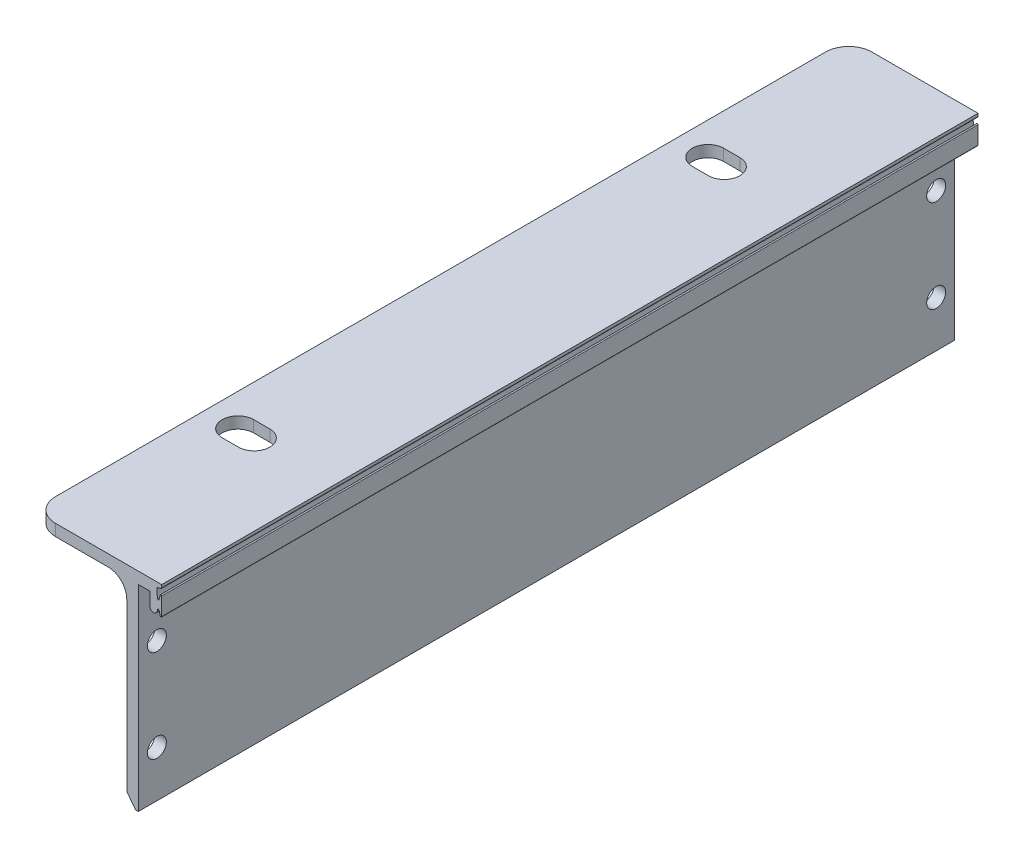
ISO-10303-21;
HEADER;
FILE_DESCRIPTION(('STEP AP214'),'2;1');
FILE_NAME('part.step','',(''),(''),'','','');
FILE_SCHEMA(('AUTOMOTIVE_DESIGN { 1 0 10303 214 1 1 1 1 }'));
ENDSEC;
DATA;
#1=APPLICATION_CONTEXT('core data for automotive mechanical design processes');
#2=APPLICATION_PROTOCOL_DEFINITION('international standard','automotive_design',2000,#1);
#3=PRODUCT_CONTEXT('',#1,'mechanical');
#4=PRODUCT('Part','Part','',(#3));
#5=PRODUCT_RELATED_PRODUCT_CATEGORY('part','',(#4));
#6=PRODUCT_DEFINITION_FORMATION('','',#4);
#7=PRODUCT_DEFINITION_CONTEXT('part definition',#1,'design');
#8=PRODUCT_DEFINITION('design','',#6,#7);
#9=PRODUCT_DEFINITION_SHAPE('','',#8);
#10=(LENGTH_UNIT() NAMED_UNIT(*) SI_UNIT(.MILLI.,.METRE.));
#11=(NAMED_UNIT(*) PLANE_ANGLE_UNIT() SI_UNIT($,.RADIAN.));
#12=(NAMED_UNIT(*) SI_UNIT($,.STERADIAN.) SOLID_ANGLE_UNIT());
#13=UNCERTAINTY_MEASURE_WITH_UNIT(LENGTH_MEASURE(1.E-05),#10,'distance_accuracy_value','');
#14=(GEOMETRIC_REPRESENTATION_CONTEXT(3) GLOBAL_UNCERTAINTY_ASSIGNED_CONTEXT((#13)) GLOBAL_UNIT_ASSIGNED_CONTEXT((#10,
#11,#12)) REPRESENTATION_CONTEXT('',''));
#15=CARTESIAN_POINT('',(0.,0.,0.));
#16=DIRECTION('',(0.,0.,1.));
#17=DIRECTION('',(1.,0.,0.));
#18=AXIS2_PLACEMENT_3D('',#15,#16,#17);
#19=CARTESIAN_POINT('',(2128.435090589,-3070.271459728,88.225));
#20=DIRECTION('',(0.,0.,-1.));
#21=DIRECTION('',(-1.,0.,0.));
#22=AXIS2_PLACEMENT_3D('',#19,#20,#21);
#23=CYLINDRICAL_SURFACE('',#22,4.);
#24=CARTESIAN_POINT('',(2128.435090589,-3070.271459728,-88.225));
#25=DIRECTION('',(0.,0.,1.));
#26=DIRECTION('',(1.,0.,0.));
#27=AXIS2_PLACEMENT_3D('',#24,#25,#26);
#28=CIRCLE('',#27,4.);
#29=CARTESIAN_POINT('',(2132.435090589,-3070.271459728,-88.225));
#30=VERTEX_POINT('',#29);
#31=CARTESIAN_POINT('',(2128.435090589,-3066.271459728,-88.225));
#32=VERTEX_POINT('',#31);
#33=EDGE_CURVE('E391',#30,#32,#28,.T.);
#34=ORIENTED_EDGE('',*,*,#33,.F.);
#35=DIRECTION('',(0.,0.,-1.));
#36=VECTOR('',#35,1.);
#37=CARTESIAN_POINT('',(2132.435090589,-3070.271459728,88.225));
#38=LINE('',#37,#36);
#39=CARTESIAN_POINT('',(2132.435090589,-3070.271459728,88.225));
#40=VERTEX_POINT('',#39);
#41=EDGE_CURVE('E506',#40,#30,#38,.T.);
#42=ORIENTED_EDGE('',*,*,#41,.F.);
#43=CARTESIAN_POINT('',(2128.435090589,-3070.271459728,88.225));
#44=DIRECTION('',(0.,0.,1.));
#45=DIRECTION('',(1.,0.,0.));
#46=AXIS2_PLACEMENT_3D('',#43,#44,#45);
#47=CIRCLE('',#46,4.);
#48=CARTESIAN_POINT('',(2128.435090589,-3066.271459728,88.225));
#49=VERTEX_POINT('',#48);
#50=EDGE_CURVE('E333',#40,#49,#47,.T.);
#51=ORIENTED_EDGE('',*,*,#50,.T.);
#52=DIRECTION('',(0.,0.,-1.));
#53=VECTOR('',#52,1.);
#54=CARTESIAN_POINT('',(2128.435090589,-3066.271459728,88.225));
#55=LINE('',#54,#53);
#56=EDGE_CURVE('E390',#49,#32,#55,.T.);
#57=ORIENTED_EDGE('',*,*,#56,.T.);
#58=EDGE_LOOP('',(#34,#42,#51,#57));
#59=FACE_BOUND('',#58,.T.);
#60=ADVANCED_FACE('F39',(#59),#23,.F.);
#61=CARTESIAN_POINT('',(2132.43509058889,7.89159512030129E-11,88.225));
#62=DIRECTION('',(1.,0.,0.));
#63=DIRECTION('',(0.,1.,0.));
#64=AXIS2_PLACEMENT_3D('',#61,#62,#63);
#65=PLANE('',#64);
#66=CARTESIAN_POINT('',(2132.435090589,-3078.771459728,84.225));
#67=DIRECTION('',(-1.,0.,0.));
#68=DIRECTION('',(0.,1.,0.));
#69=AXIS2_PLACEMENT_3D('',#66,#67,#68);
#70=CIRCLE('',#69,2.0499999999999);
#71=CARTESIAN_POINT('',(2132.435090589,-3076.721459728,84.225));
#72=VERTEX_POINT('',#71);
#73=EDGE_CURVE('E311',#72,#72,#70,.T.);
#74=ORIENTED_EDGE('',*,*,#73,.F.);
#75=EDGE_LOOP('',(#74));
#76=FACE_BOUND('',#75,.T.);
#77=CARTESIAN_POINT('',(2132.435090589,-3098.771459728,84.225));
#78=DIRECTION('',(-1.,0.,0.));
#79=DIRECTION('',(0.,1.,0.));
#80=AXIS2_PLACEMENT_3D('',#77,#78,#79);
#81=CIRCLE('',#80,2.0499999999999);
#82=CARTESIAN_POINT('',(2132.435090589,-3096.721459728,84.225));
#83=VERTEX_POINT('',#82);
#84=EDGE_CURVE('E321',#83,#83,#81,.T.);
#85=ORIENTED_EDGE('',*,*,#84,.F.);
#86=EDGE_LOOP('',(#85));
#87=FACE_BOUND('',#86,.T.);
#88=CARTESIAN_POINT('',(2132.435090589,-3098.771459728,-84.225));
#89=DIRECTION('',(-1.,0.,0.));
#90=DIRECTION('',(0.,-1.,0.));
#91=AXIS2_PLACEMENT_3D('',#88,#89,#90);
#92=CIRCLE('',#91,2.0499999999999);
#93=CARTESIAN_POINT('',(2132.435090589,-3100.821459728,-84.225));
#94=VERTEX_POINT('',#93);
#95=EDGE_CURVE('E325',#94,#94,#92,.T.);
#96=ORIENTED_EDGE('',*,*,#95,.F.);
#97=EDGE_LOOP('',(#96));
#98=FACE_BOUND('',#97,.T.);
#99=CARTESIAN_POINT('',(2132.435090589,-3078.771459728,-84.225));
#100=DIRECTION('',(-1.,0.,0.));
#101=DIRECTION('',(0.,-1.,0.));
#102=AXIS2_PLACEMENT_3D('',#99,#100,#101);
#103=CIRCLE('',#102,2.0499999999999);
#104=CARTESIAN_POINT('',(2132.435090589,-3080.821459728,-84.225));
#105=VERTEX_POINT('',#104);
#106=EDGE_CURVE('E329',#105,#105,#103,.T.);
#107=ORIENTED_EDGE('',*,*,#106,.F.);
#108=EDGE_LOOP('',(#107));
#109=FACE_BOUND('',#108,.T.);
#110=DIRECTION('',(0.,-1.,0.));
#111=VECTOR('',#110,1.);
#112=CARTESIAN_POINT('',(2132.43509058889,7.89159512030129E-11,-88.225));
#113=LINE('',#112,#111);
#114=CARTESIAN_POINT('',(2132.435090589,-3106.271459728,-88.225));
#115=VERTEX_POINT('',#114);
#116=EDGE_CURVE('E394',#30,#115,#113,.T.);
#117=ORIENTED_EDGE('',*,*,#116,.T.);
#118=DIRECTION('',(0.,0.,-1.));
#119=VECTOR('',#118,1.);
#120=CARTESIAN_POINT('',(2132.435090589,-3106.271459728,88.225));
#121=LINE('',#120,#119);
#122=CARTESIAN_POINT('',(2132.435090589,-3106.271459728,88.225));
#123=VERTEX_POINT('',#122);
#124=EDGE_CURVE('E503',#123,#115,#121,.T.);
#125=ORIENTED_EDGE('',*,*,#124,.F.);
#126=DIRECTION('',(0.,-1.,0.));
#127=VECTOR('',#126,1.);
#128=CARTESIAN_POINT('',(2132.43509058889,7.89159512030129E-11,88.225));
#129=LINE('',#128,#127);
#130=EDGE_CURVE('E336',#40,#123,#129,.T.);
#131=ORIENTED_EDGE('',*,*,#130,.F.);
#132=ORIENTED_EDGE('',*,*,#41,.T.);
#133=EDGE_LOOP('',(#117,#125,#131,#132));
#134=FACE_BOUND('',#133,.T.);
#135=ADVANCED_FACE('F576',(#76,#87,#98,#109,#134),#65,.F.);
#136=CARTESIAN_POINT('',(-144.733277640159,-109.997291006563,88.225));
#137=DIRECTION('',(0.796162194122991,0.605083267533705,0.));
#138=DIRECTION('',(-0.605083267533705,0.796162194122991,0.));
#139=AXIS2_PLACEMENT_3D('',#136,#137,#138);
#140=PLANE('',#139);
#141=DIRECTION('',(0.605083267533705,-0.796162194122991,0.));
#142=VECTOR('',#141,1.);
#143=CARTESIAN_POINT('',(-144.733277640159,-109.997291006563,-88.225));
#144=LINE('',#143,#142);
#145=CARTESIAN_POINT('',(2134.335090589,-3108.771459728,-88.225));
#146=VERTEX_POINT('',#145);
#147=EDGE_CURVE('E396',#115,#146,#144,.T.);
#148=ORIENTED_EDGE('',*,*,#147,.T.);
#149=DIRECTION('',(0.,0.,-1.));
#150=VECTOR('',#149,1.);
#151=CARTESIAN_POINT('',(2134.335090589,-3108.771459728,88.225));
#152=LINE('',#151,#150);
#153=CARTESIAN_POINT('',(2134.335090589,-3108.771459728,88.225));
#154=VERTEX_POINT('',#153);
#155=EDGE_CURVE('E501',#154,#146,#152,.T.);
#156=ORIENTED_EDGE('',*,*,#155,.F.);
#157=DIRECTION('',(0.605083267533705,-0.796162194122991,0.));
#158=VECTOR('',#157,1.);
#159=CARTESIAN_POINT('',(-144.733277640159,-109.997291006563,88.225));
#160=LINE('',#159,#158);
#161=EDGE_CURVE('E339',#123,#154,#160,.T.);
#162=ORIENTED_EDGE('',*,*,#161,.F.);
#163=ORIENTED_EDGE('',*,*,#124,.T.);
#164=EDGE_LOOP('',(#148,#156,#162,#163));
#165=FACE_BOUND('',#164,.T.);
#166=ADVANCED_FACE('F581',(#165),#140,.F.);
#167=CARTESIAN_POINT('',(0.,-3108.771459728,88.225));
#168=DIRECTION('',(0.,-1.,0.));
#169=DIRECTION('',(0.,0.,-1.));
#170=AXIS2_PLACEMENT_3D('',#167,#168,#169);
#171=PLANE('',#170);
#172=DIRECTION('',(-1.,0.,0.));
#173=VECTOR('',#172,1.);
#174=CARTESIAN_POINT('',(0.,-3108.771459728,-88.225));
#175=LINE('',#174,#173);
#176=CARTESIAN_POINT('',(2134.93509058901,-3108.771459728,-88.225));
#177=VERTEX_POINT('',#176);
#178=EDGE_CURVE('E399',#177,#146,#175,.T.);
#179=ORIENTED_EDGE('',*,*,#178,.F.);
#180=DIRECTION('',(0.,0.,-1.));
#181=VECTOR('',#180,1.);
#182=CARTESIAN_POINT('',(2134.93509058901,-3108.771459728,88.225));
#183=LINE('',#182,#181);
#184=CARTESIAN_POINT('',(2134.93509058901,-3108.771459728,88.225));
#185=VERTEX_POINT('',#184);
#186=EDGE_CURVE('E499',#185,#177,#183,.T.);
#187=ORIENTED_EDGE('',*,*,#186,.F.);
#188=DIRECTION('',(-1.,0.,0.));
#189=VECTOR('',#188,1.);
#190=CARTESIAN_POINT('',(0.,-3108.771459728,88.225));
#191=LINE('',#190,#189);
#192=EDGE_CURVE('E341',#185,#154,#191,.T.);
#193=ORIENTED_EDGE('',*,*,#192,.T.);
#194=ORIENTED_EDGE('',*,*,#155,.T.);
#195=EDGE_LOOP('',(#179,#187,#193,#194));
#196=FACE_BOUND('',#195,.T.);
#197=ADVANCED_FACE('F587',(#196),#171,.T.);
#198=CARTESIAN_POINT('',(2134.93509058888,8.92330952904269E-11,88.225));
#199=DIRECTION('',(1.,0.,0.));
#200=DIRECTION('',(0.,1.,0.));
#201=AXIS2_PLACEMENT_3D('',#198,#199,#200);
#202=PLANE('',#201);
#203=CARTESIAN_POINT('',(2134.935090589,-3078.771459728,84.225));
#204=DIRECTION('',(1.,0.,0.));
#205=DIRECTION('',(0.,1.,0.));
#206=AXIS2_PLACEMENT_3D('',#203,#204,#205);
#207=CIRCLE('',#206,2.0499999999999);
#208=CARTESIAN_POINT('',(2134.935090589,-3076.721459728,84.225));
#209=VERTEX_POINT('',#208);
#210=EDGE_CURVE('E320',#209,#209,#207,.T.);
#211=ORIENTED_EDGE('',*,*,#210,.F.);
#212=EDGE_LOOP('',(#211));
#213=FACE_BOUND('',#212,.T.);
#214=CARTESIAN_POINT('',(2134.935090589,-3098.771459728,84.225));
#215=DIRECTION('',(1.,0.,0.));
#216=DIRECTION('',(0.,1.,0.));
#217=AXIS2_PLACEMENT_3D('',#214,#215,#216);
#218=CIRCLE('',#217,2.0499999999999);
#219=CARTESIAN_POINT('',(2134.935090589,-3096.721459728,84.225));
#220=VERTEX_POINT('',#219);
#221=EDGE_CURVE('E324',#220,#220,#218,.T.);
#222=ORIENTED_EDGE('',*,*,#221,.F.);
#223=EDGE_LOOP('',(#222));
#224=FACE_BOUND('',#223,.T.);
#225=CARTESIAN_POINT('',(2134.935090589,-3098.771459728,-84.225));
#226=DIRECTION('',(1.,0.,0.));
#227=DIRECTION('',(0.,1.,0.));
#228=AXIS2_PLACEMENT_3D('',#225,#226,#227);
#229=CIRCLE('',#228,2.0499999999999);
#230=CARTESIAN_POINT('',(2134.935090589,-3096.721459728,-84.225));
#231=VERTEX_POINT('',#230);
#232=EDGE_CURVE('E328',#231,#231,#229,.T.);
#233=ORIENTED_EDGE('',*,*,#232,.F.);
#234=EDGE_LOOP('',(#233));
#235=FACE_BOUND('',#234,.T.);
#236=CARTESIAN_POINT('',(2134.935090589,-3078.771459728,-84.225));
#237=DIRECTION('',(1.,0.,0.));
#238=DIRECTION('',(0.,1.,0.));
#239=AXIS2_PLACEMENT_3D('',#236,#237,#238);
#240=CIRCLE('',#239,2.0499999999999);
#241=CARTESIAN_POINT('',(2134.935090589,-3076.721459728,-84.225));
#242=VERTEX_POINT('',#241);
#243=EDGE_CURVE('E332',#242,#242,#240,.T.);
#244=ORIENTED_EDGE('',*,*,#243,.F.);
#245=EDGE_LOOP('',(#244));
#246=FACE_BOUND('',#245,.T.);
#247=DIRECTION('',(0.,-1.,0.));
#248=VECTOR('',#247,1.);
#249=CARTESIAN_POINT('',(2134.93509058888,8.92330952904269E-11,-88.225));
#250=LINE('',#249,#248);
#251=CARTESIAN_POINT('',(2134.935090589,-3066.271459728,-88.225));
#252=VERTEX_POINT('',#251);
#253=EDGE_CURVE('E402',#252,#177,#250,.T.);
#254=ORIENTED_EDGE('',*,*,#253,.F.);
#255=DIRECTION('',(0.,0.,-1.));
#256=VECTOR('',#255,1.);
#257=CARTESIAN_POINT('',(2134.935090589,-3066.271459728,88.225));
#258=LINE('',#257,#256);
#259=CARTESIAN_POINT('',(2134.935090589,-3066.271459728,88.225));
#260=VERTEX_POINT('',#259);
#261=EDGE_CURVE('E497',#260,#252,#258,.T.);
#262=ORIENTED_EDGE('',*,*,#261,.F.);
#263=DIRECTION('',(0.,-1.,0.));
#264=VECTOR('',#263,1.);
#265=CARTESIAN_POINT('',(2134.93509058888,8.92330952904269E-11,88.225));
#266=LINE('',#265,#264);
#267=EDGE_CURVE('E344',#260,#185,#266,.T.);
#268=ORIENTED_EDGE('',*,*,#267,.T.);
#269=ORIENTED_EDGE('',*,*,#186,.T.);
#270=EDGE_LOOP('',(#254,#262,#268,#269));
#271=FACE_BOUND('',#270,.T.);
#272=ADVANCED_FACE('F591',(#213,#224,#235,#246,#271),#202,.T.);
#273=CARTESIAN_POINT('',(-1.08935845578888E-09,-3066.27145972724,88.225));
#274=DIRECTION('',(3.55271367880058E-13,1.,0.));
#275=DIRECTION('',(-1.,3.55271367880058E-13,0.));
#276=AXIS2_PLACEMENT_3D('',#273,#274,#275);
#277=PLANE('',#276);
#278=DIRECTION('',(1.,-3.55271367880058E-13,0.));
#279=VECTOR('',#278,1.);
#280=CARTESIAN_POINT('',(-1.08935845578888E-09,-3066.27145972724,-88.225));
#281=LINE('',#280,#279);
#282=CARTESIAN_POINT('',(2137.435090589,-3066.271459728,-88.225));
#283=VERTEX_POINT('',#282);
#284=EDGE_CURVE('E405',#252,#283,#281,.T.);
#285=ORIENTED_EDGE('',*,*,#284,.T.);
#286=DIRECTION('',(0.,0.,-1.));
#287=VECTOR('',#286,1.);
#288=CARTESIAN_POINT('',(2137.435090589,-3066.271459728,88.225));
#289=LINE('',#288,#287);
#290=CARTESIAN_POINT('',(2137.435090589,-3066.271459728,88.225));
#291=VERTEX_POINT('',#290);
#292=EDGE_CURVE('E494',#291,#283,#289,.T.);
#293=ORIENTED_EDGE('',*,*,#292,.F.);
#294=DIRECTION('',(1.,-3.55271367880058E-13,0.));
#295=VECTOR('',#294,1.);
#296=CARTESIAN_POINT('',(-1.08935845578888E-09,-3066.27145972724,88.225));
#297=LINE('',#296,#295);
#298=EDGE_CURVE('E347',#260,#291,#297,.T.);
#299=ORIENTED_EDGE('',*,*,#298,.F.);
#300=ORIENTED_EDGE('',*,*,#261,.T.);
#301=EDGE_LOOP('',(#285,#293,#299,#300));
#302=FACE_BOUND('',#301,.T.);
#303=ADVANCED_FACE('F595',(#302),#277,.F.);
#304=CARTESIAN_POINT('',(2137.43509058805,6.62327875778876E-10,88.225));
#305=DIRECTION('',(1.,3.09870404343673E-13,0.));
#306=DIRECTION('',(-3.09870404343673E-13,1.,0.));
#307=AXIS2_PLACEMENT_3D('',#304,#305,#306);
#308=PLANE('',#307);
#309=DIRECTION('',(3.09870404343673E-13,-1.,0.));
#310=VECTOR('',#309,1.);
#311=CARTESIAN_POINT('',(2137.43509058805,6.62327875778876E-10,-88.225));
#312=LINE('',#311,#310);
#313=CARTESIAN_POINT('',(2137.435090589,-3069.1377496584,-88.225));
#314=VERTEX_POINT('',#313);
#315=EDGE_CURVE('E407',#283,#314,#312,.T.);
#316=ORIENTED_EDGE('',*,*,#315,.T.);
#317=DIRECTION('',(0.,0.,-1.));
#318=VECTOR('',#317,1.);
#319=CARTESIAN_POINT('',(2137.435090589,-3069.1377496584,88.225));
#320=LINE('',#319,#318);
#321=CARTESIAN_POINT('',(2137.435090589,-3069.1377496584,88.225));
#322=VERTEX_POINT('',#321);
#323=EDGE_CURVE('E491',#322,#314,#320,.T.);
#324=ORIENTED_EDGE('',*,*,#323,.F.);
#325=DIRECTION('',(3.09870404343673E-13,-1.,0.));
#326=VECTOR('',#325,1.);
#327=CARTESIAN_POINT('',(2137.43509058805,6.62327875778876E-10,88.225));
#328=LINE('',#327,#326);
#329=EDGE_CURVE('E349',#291,#322,#328,.T.);
#330=ORIENTED_EDGE('',*,*,#329,.F.);
#331=ORIENTED_EDGE('',*,*,#292,.T.);
#332=EDGE_LOOP('',(#316,#324,#330,#331));
#333=FACE_BOUND('',#332,.T.);
#334=ADVANCED_FACE('F599',(#333),#308,.F.);
#335=CARTESIAN_POINT('',(2138.2188006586,-3069.1377496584,88.225));
#336=DIRECTION('',(0.,0.,-1.));
#337=DIRECTION('',(-1.,0.,0.));
#338=AXIS2_PLACEMENT_3D('',#335,#336,#337);
#339=CYLINDRICAL_SURFACE('',#338,0.783710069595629);
#340=CARTESIAN_POINT('',(2138.2188006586,-3069.1377496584,-88.225));
#341=DIRECTION('',(0.,0.,1.));
#342=DIRECTION('',(1.,0.,0.));
#343=AXIS2_PLACEMENT_3D('',#340,#341,#342);
#344=CIRCLE('',#343,0.783710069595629);
#345=CARTESIAN_POINT('',(2138.97524023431,-3069.34269023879,-88.225));
#346=VERTEX_POINT('',#345);
#347=EDGE_CURVE('E409',#314,#346,#344,.T.);
#348=ORIENTED_EDGE('',*,*,#347,.T.);
#349=DIRECTION('',(0.,0.,-1.));
#350=VECTOR('',#349,1.);
#351=CARTESIAN_POINT('',(2138.97524023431,-3069.34269023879,88.225));
#352=LINE('',#351,#350);
#353=CARTESIAN_POINT('',(2138.97524023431,-3069.34269023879,88.225));
#354=VERTEX_POINT('',#353);
#355=EDGE_CURVE('E488',#354,#346,#352,.T.);
#356=ORIENTED_EDGE('',*,*,#355,.F.);
#357=CARTESIAN_POINT('',(2138.2188006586,-3069.1377496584,88.225));
#358=DIRECTION('',(0.,0.,1.));
#359=DIRECTION('',(1.,0.,0.));
#360=AXIS2_PLACEMENT_3D('',#357,#358,#359);
#361=CIRCLE('',#360,0.783710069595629);
#362=EDGE_CURVE('E351',#322,#354,#361,.T.);
#363=ORIENTED_EDGE('',*,*,#362,.F.);
#364=ORIENTED_EDGE('',*,*,#323,.T.);
#365=EDGE_LOOP('',(#348,#356,#363,#364));
#366=FACE_BOUND('',#365,.T.);
#367=ADVANCED_FACE('F603',(#366),#339,.T.);
#368=CARTESIAN_POINT('',(2767.41239594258,-749.769209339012,88.225));
#369=DIRECTION('',(-0.965203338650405,0.261500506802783,0.));
#370=DIRECTION('',(-0.261500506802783,-0.965203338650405,0.));
#371=AXIS2_PLACEMENT_3D('',#368,#369,#370);
#372=PLANE('',#371);
#373=DIRECTION('',(0.261500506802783,0.965203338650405,0.));
#374=VECTOR('',#373,1.);
#375=CARTESIAN_POINT('',(2767.41239594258,-749.769209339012,-88.225));
#376=LINE('',#375,#374);
#377=CARTESIAN_POINT('',(2139.12031008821,-3068.80723465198,-88.225));
#378=VERTEX_POINT('',#377);
#379=EDGE_CURVE('E411',#346,#378,#376,.T.);
#380=ORIENTED_EDGE('',*,*,#379,.T.);
#381=DIRECTION('',(0.,0.,-1.));
#382=VECTOR('',#381,1.);
#383=CARTESIAN_POINT('',(2139.12031008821,-3068.80723465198,88.225));
#384=LINE('',#383,#382);
#385=CARTESIAN_POINT('',(2139.12031008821,-3068.80723465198,88.225));
#386=VERTEX_POINT('',#385);
#387=EDGE_CURVE('E486',#386,#378,#384,.T.);
#388=ORIENTED_EDGE('',*,*,#387,.F.);
#389=DIRECTION('',(0.261500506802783,0.965203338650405,0.));
#390=VECTOR('',#389,1.);
#391=CARTESIAN_POINT('',(2767.41239594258,-749.769209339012,88.225));
#392=LINE('',#391,#390);
#393=EDGE_CURVE('E353',#354,#386,#392,.T.);
#394=ORIENTED_EDGE('',*,*,#393,.F.);
#395=ORIENTED_EDGE('',*,*,#355,.T.);
#396=EDGE_LOOP('',(#380,#388,#394,#395));
#397=FACE_BOUND('',#396,.T.);
#398=ADVANCED_FACE('F607',(#397),#372,.F.);
#399=CARTESIAN_POINT('',(2139.265090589,-3068.846459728,88.225));
#400=DIRECTION('',(0.,0.,-1.));
#401=DIRECTION('',(-1.,0.,0.));
#402=AXIS2_PLACEMENT_3D('',#399,#400,#401);
#403=CYLINDRICAL_SURFACE('',#402,0.149999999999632);
#404=CARTESIAN_POINT('',(2139.265090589,-3068.846459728,-88.225));
#405=DIRECTION('',(0.,0.,1.));
#406=DIRECTION('',(1.,0.,0.));
#407=AXIS2_PLACEMENT_3D('',#404,#405,#406);
#408=CIRCLE('',#407,0.149999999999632);
#409=CARTESIAN_POINT('',(2139.41070658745,-3068.81045999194,-88.225));
#410=VERTEX_POINT('',#409);
#411=EDGE_CURVE('E414',#410,#378,#408,.T.);
#412=ORIENTED_EDGE('',*,*,#411,.F.);
#413=DIRECTION('',(0.,0.,-1.));
#414=VECTOR('',#413,1.);
#415=CARTESIAN_POINT('',(2139.41070658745,-3068.81045999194,88.225));
#416=LINE('',#415,#414);
#417=CARTESIAN_POINT('',(2139.41070658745,-3068.81045999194,88.225));
#418=VERTEX_POINT('',#417);
#419=EDGE_CURVE('E484',#418,#410,#416,.T.);
#420=ORIENTED_EDGE('',*,*,#419,.F.);
#421=CARTESIAN_POINT('',(2139.265090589,-3068.846459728,88.225));
#422=DIRECTION('',(0.,0.,1.));
#423=DIRECTION('',(1.,0.,0.));
#424=AXIS2_PLACEMENT_3D('',#421,#422,#423);
#425=CIRCLE('',#424,0.149999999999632);
#426=EDGE_CURVE('E355',#418,#386,#425,.T.);
#427=ORIENTED_EDGE('',*,*,#426,.T.);
#428=ORIENTED_EDGE('',*,*,#387,.T.);
#429=EDGE_LOOP('',(#412,#420,#427,#428));
#430=FACE_BOUND('',#429,.T.);
#431=ADVANCED_FACE('F611',(#430),#403,.F.);
#432=CARTESIAN_POINT('',(1301.19906034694,321.687336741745,88.225));
#433=DIRECTION('',(0.970773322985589,0.239998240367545,0.));
#434=DIRECTION('',(-0.239998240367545,0.970773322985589,0.));
#435=AXIS2_PLACEMENT_3D('',#432,#433,#434);
#436=PLANE('',#435);
#437=DIRECTION('',(0.239998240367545,-0.970773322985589,0.));
#438=VECTOR('',#437,1.);
#439=CARTESIAN_POINT('',(1301.19906034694,321.687336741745,-88.225));
#440=LINE('',#439,#438);
#441=CARTESIAN_POINT('',(2139.65483992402,-3069.79795944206,-88.225));
#442=VERTEX_POINT('',#441);
#443=EDGE_CURVE('E417',#410,#442,#440,.T.);
#444=ORIENTED_EDGE('',*,*,#443,.T.);
#445=DIRECTION('',(0.,0.,-1.));
#446=VECTOR('',#445,1.);
#447=CARTESIAN_POINT('',(2139.65483992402,-3069.79795944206,88.225));
#448=LINE('',#447,#446);
#449=CARTESIAN_POINT('',(2139.65483992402,-3069.79795944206,88.225));
#450=VERTEX_POINT('',#449);
#451=EDGE_CURVE('E481',#450,#442,#448,.T.);
#452=ORIENTED_EDGE('',*,*,#451,.F.);
#453=DIRECTION('',(0.239998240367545,-0.970773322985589,0.));
#454=VECTOR('',#453,1.);
#455=CARTESIAN_POINT('',(1301.19906034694,321.687336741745,88.225));
#456=LINE('',#455,#454);
#457=EDGE_CURVE('E358',#418,#450,#456,.T.);
#458=ORIENTED_EDGE('',*,*,#457,.F.);
#459=ORIENTED_EDGE('',*,*,#419,.T.);
#460=EDGE_LOOP('',(#444,#452,#458,#459));
#461=FACE_BOUND('',#460,.T.);
#462=ADVANCED_FACE('F615',(#461),#436,.F.);
#463=CARTESIAN_POINT('',(2139.812590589,-3069.758959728,88.225));
#464=DIRECTION('',(0.,0.,-1.));
#465=DIRECTION('',(-1.,0.,0.));
#466=AXIS2_PLACEMENT_3D('',#463,#464,#465);
#467=CYLINDRICAL_SURFACE('',#466,0.162500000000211);
#468=CARTESIAN_POINT('',(2139.812590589,-3069.758959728,-88.225));
#469=DIRECTION('',(0.,0.,1.));
#470=DIRECTION('',(1.,0.,0.));
#471=AXIS2_PLACEMENT_3D('',#468,#469,#470);
#472=CIRCLE('',#471,0.162500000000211);
#473=CARTESIAN_POINT('',(2139.97509058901,-3069.758959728,-88.225));
#474=VERTEX_POINT('',#473);
#475=EDGE_CURVE('E419',#442,#474,#472,.T.);
#476=ORIENTED_EDGE('',*,*,#475,.T.);
#477=DIRECTION('',(0.,0.,-1.));
#478=VECTOR('',#477,1.);
#479=CARTESIAN_POINT('',(2139.97509058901,-3069.758959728,88.225));
#480=LINE('',#479,#478);
#481=CARTESIAN_POINT('',(2139.97509058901,-3069.758959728,88.225));
#482=VERTEX_POINT('',#481);
#483=EDGE_CURVE('E479',#482,#474,#480,.T.);
#484=ORIENTED_EDGE('',*,*,#483,.F.);
#485=CARTESIAN_POINT('',(2139.812590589,-3069.758959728,88.225));
#486=DIRECTION('',(0.,0.,1.));
#487=DIRECTION('',(1.,0.,0.));
#488=AXIS2_PLACEMENT_3D('',#485,#486,#487);
#489=CIRCLE('',#488,0.162500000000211);
#490=EDGE_CURVE('E360',#450,#482,#489,.T.);
#491=ORIENTED_EDGE('',*,*,#490,.F.);
#492=ORIENTED_EDGE('',*,*,#451,.T.);
#493=EDGE_LOOP('',(#476,#484,#491,#492));
#494=FACE_BOUND('',#493,.T.);
#495=ADVANCED_FACE('F619',(#494),#467,.T.);
#496=CARTESIAN_POINT('',(2139.97509058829,4.96909723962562E-10,88.225));
#497=DIRECTION('',(1.,2.32203508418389E-13,0.));
#498=DIRECTION('',(-2.32203508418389E-13,1.,0.));
#499=AXIS2_PLACEMENT_3D('',#496,#497,#498);
#500=PLANE('',#499);
#501=DIRECTION('',(2.32203508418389E-13,-1.,0.));
#502=VECTOR('',#501,1.);
#503=CARTESIAN_POINT('',(2139.97509058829,4.96909723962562E-10,-88.225));
#504=LINE('',#503,#502);
#505=CARTESIAN_POINT('',(2139.975090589,-3065.933959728,-88.225));
#506=VERTEX_POINT('',#505);
#507=EDGE_CURVE('E422',#506,#474,#504,.T.);
#508=ORIENTED_EDGE('',*,*,#507,.F.);
#509=DIRECTION('',(0.,0.,-1.));
#510=VECTOR('',#509,1.);
#511=CARTESIAN_POINT('',(2139.975090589,-3065.933959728,88.225));
#512=LINE('',#511,#510);
#513=CARTESIAN_POINT('',(2139.975090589,-3065.933959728,88.225));
#514=VERTEX_POINT('',#513);
#515=EDGE_CURVE('E477',#514,#506,#512,.T.);
#516=ORIENTED_EDGE('',*,*,#515,.F.);
#517=DIRECTION('',(2.32203508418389E-13,-1.,0.));
#518=VECTOR('',#517,1.);
#519=CARTESIAN_POINT('',(2139.97509058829,4.96909723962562E-10,88.225));
#520=LINE('',#519,#518);
#521=EDGE_CURVE('E362',#514,#482,#520,.T.);
#522=ORIENTED_EDGE('',*,*,#521,.T.);
#523=ORIENTED_EDGE('',*,*,#483,.T.);
#524=EDGE_LOOP('',(#508,#516,#522,#523));
#525=FACE_BOUND('',#524,.T.);
#526=ADVANCED_FACE('F623',(#525),#500,.T.);
#527=CARTESIAN_POINT('',(2139.812590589,-3065.933959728,88.225));
#528=DIRECTION('',(0.,0.,-1.));
#529=DIRECTION('',(-1.,0.,0.));
#530=AXIS2_PLACEMENT_3D('',#527,#528,#529);
#531=CYLINDRICAL_SURFACE('',#530,0.162500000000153);
#532=CARTESIAN_POINT('',(2139.812590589,-3065.933959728,-88.225));
#533=DIRECTION('',(0.,0.,1.));
#534=DIRECTION('',(1.,0.,0.));
#535=AXIS2_PLACEMENT_3D('',#532,#533,#534);
#536=CIRCLE('',#535,0.162500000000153);
#537=CARTESIAN_POINT('',(2139.65483992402,-3065.89496001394,-88.225));
#538=VERTEX_POINT('',#537);
#539=EDGE_CURVE('E425',#506,#538,#536,.T.);
#540=ORIENTED_EDGE('',*,*,#539,.T.);
#541=DIRECTION('',(0.,0.,-1.));
#542=VECTOR('',#541,1.);
#543=CARTESIAN_POINT('',(2139.65483992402,-3065.89496001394,88.225));
#544=LINE('',#543,#542);
#545=CARTESIAN_POINT('',(2139.65483992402,-3065.89496001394,88.225));
#546=VERTEX_POINT('',#545);
#547=EDGE_CURVE('E475',#546,#538,#544,.T.);
#548=ORIENTED_EDGE('',*,*,#547,.F.);
#549=CARTESIAN_POINT('',(2139.812590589,-3065.933959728,88.225));
#550=DIRECTION('',(0.,0.,1.));
#551=DIRECTION('',(1.,0.,0.));
#552=AXIS2_PLACEMENT_3D('',#549,#550,#551);
#553=CIRCLE('',#552,0.162500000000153);
#554=EDGE_CURVE('E365',#514,#546,#553,.T.);
#555=ORIENTED_EDGE('',*,*,#554,.F.);
#556=ORIENTED_EDGE('',*,*,#515,.T.);
#557=EDGE_LOOP('',(#540,#548,#555,#556));
#558=FACE_BOUND('',#557,.T.);
#559=ADVANCED_FACE('F627',(#558),#531,.T.);
#560=CARTESIAN_POINT('',(2730.71666034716,-675.098066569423,88.225));
#561=DIRECTION('',(-0.970773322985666,0.23999824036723,0.));
#562=DIRECTION('',(-0.23999824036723,-0.970773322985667,0.));
#563=AXIS2_PLACEMENT_3D('',#560,#561,#562);
#564=PLANE('',#563);
#565=DIRECTION('',(0.23999824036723,0.970773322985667,0.));
#566=VECTOR('',#565,1.);
#567=CARTESIAN_POINT('',(2730.71666034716,-675.098066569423,-88.225));
#568=LINE('',#567,#566);
#569=CARTESIAN_POINT('',(2139.41070658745,-3066.88245946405,-88.225));
#570=VERTEX_POINT('',#569);
#571=EDGE_CURVE('E428',#570,#538,#568,.T.);
#572=ORIENTED_EDGE('',*,*,#571,.F.);
#573=DIRECTION('',(0.,0.,-1.));
#574=VECTOR('',#573,1.);
#575=CARTESIAN_POINT('',(2139.41070658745,-3066.88245946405,88.225));
#576=LINE('',#575,#574);
#577=CARTESIAN_POINT('',(2139.41070658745,-3066.88245946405,88.225));
#578=VERTEX_POINT('',#577);
#579=EDGE_CURVE('E473',#578,#570,#576,.T.);
#580=ORIENTED_EDGE('',*,*,#579,.F.);
#581=DIRECTION('',(0.23999824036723,0.970773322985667,0.));
#582=VECTOR('',#581,1.);
#583=CARTESIAN_POINT('',(2730.71666034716,-675.098066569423,88.225));
#584=LINE('',#583,#582);
#585=EDGE_CURVE('E367',#578,#546,#584,.T.);
#586=ORIENTED_EDGE('',*,*,#585,.T.);
#587=ORIENTED_EDGE('',*,*,#547,.T.);
#588=EDGE_LOOP('',(#572,#580,#586,#587));
#589=FACE_BOUND('',#588,.T.);
#590=ADVANCED_FACE('F631',(#589),#564,.T.);
#591=CARTESIAN_POINT('',(2139.265090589,-3066.846459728,88.225));
#592=DIRECTION('',(0.,0.,-1.));
#593=DIRECTION('',(-1.,0.,0.));
#594=AXIS2_PLACEMENT_3D('',#591,#592,#593);
#595=CYLINDRICAL_SURFACE('',#594,0.149999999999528);
#596=CARTESIAN_POINT('',(2139.265090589,-3066.846459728,-88.225));
#597=DIRECTION('',(0.,0.,1.));
#598=DIRECTION('',(1.,0.,0.));
#599=AXIS2_PLACEMENT_3D('',#596,#597,#598);
#600=CIRCLE('',#599,0.149999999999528);
#601=CARTESIAN_POINT('',(2139.11611424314,-3066.86395396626,-88.225));
#602=VERTEX_POINT('',#601);
#603=EDGE_CURVE('E431',#602,#570,#600,.T.);
#604=ORIENTED_EDGE('',*,*,#603,.F.);
#605=DIRECTION('',(0.,0.,-1.));
#606=VECTOR('',#605,1.);
#607=CARTESIAN_POINT('',(2139.11611424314,-3066.86395396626,88.225));
#608=LINE('',#607,#606);
#609=CARTESIAN_POINT('',(2139.11611424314,-3066.86395396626,88.225));
#610=VERTEX_POINT('',#609);
#611=EDGE_CURVE('E471',#610,#602,#608,.T.);
#612=ORIENTED_EDGE('',*,*,#611,.F.);
#613=CARTESIAN_POINT('',(2139.265090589,-3066.846459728,88.225));
#614=DIRECTION('',(0.,0.,1.));
#615=DIRECTION('',(1.,0.,0.));
#616=AXIS2_PLACEMENT_3D('',#613,#614,#615);
#617=CIRCLE('',#616,0.149999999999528);
#618=EDGE_CURVE('E370',#610,#578,#617,.T.);
#619=ORIENTED_EDGE('',*,*,#618,.T.);
#620=ORIENTED_EDGE('',*,*,#579,.T.);
#621=EDGE_LOOP('',(#604,#612,#619,#620));
#622=FACE_BOUND('',#621,.T.);
#623=ADVANCED_FACE('F635',(#622),#595,.F.);
#624=CARTESIAN_POINT('',(2145.36317534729,-3065.27398447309,88.225));
#625=DIRECTION('',(0.,0.,-1.));
#626=DIRECTION('',(-1.,0.,0.));
#627=AXIS2_PLACEMENT_3D('',#624,#625,#626);
#628=CYLINDRICAL_SURFACE('',#627,6.44622179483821);
#629=CARTESIAN_POINT('',(2145.36317534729,-3065.27398447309,-88.225));
#630=DIRECTION('',(0.,0.,1.));
#631=DIRECTION('',(1.,0.,0.));
#632=AXIS2_PLACEMENT_3D('',#629,#630,#631);
#633=CIRCLE('',#632,6.44622179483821);
#634=CARTESIAN_POINT('',(2138.92214729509,-3065.01527023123,-88.225));
#635=VERTEX_POINT('',#634);
#636=EDGE_CURVE('E434',#635,#602,#633,.T.);
#637=ORIENTED_EDGE('',*,*,#636,.F.);
#638=DIRECTION('',(0.,0.,-1.));
#639=VECTOR('',#638,1.);
#640=CARTESIAN_POINT('',(2138.92214729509,-3065.01527023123,88.225));
#641=LINE('',#640,#639);
#642=CARTESIAN_POINT('',(2138.92214729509,-3065.01527023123,88.225));
#643=VERTEX_POINT('',#642);
#644=EDGE_CURVE('E469',#643,#635,#641,.T.);
#645=ORIENTED_EDGE('',*,*,#644,.F.);
#646=CARTESIAN_POINT('',(2145.36317534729,-3065.27398447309,88.225));
#647=DIRECTION('',(0.,0.,1.));
#648=DIRECTION('',(1.,0.,0.));
#649=AXIS2_PLACEMENT_3D('',#646,#647,#648);
#650=CIRCLE('',#649,6.44622179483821);
#651=EDGE_CURVE('E373',#643,#610,#650,.T.);
#652=ORIENTED_EDGE('',*,*,#651,.T.);
#653=ORIENTED_EDGE('',*,*,#611,.T.);
#654=EDGE_LOOP('',(#637,#645,#652,#653));
#655=FACE_BOUND('',#654,.T.);
#656=ADVANCED_FACE('F639',(#655),#628,.F.);
#657=CARTESIAN_POINT('',(2139.22190558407,-3065.02731050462,88.225));
#658=DIRECTION('',(0.,0.,-1.));
#659=DIRECTION('',(-1.,0.,0.));
#660=AXIS2_PLACEMENT_3D('',#657,#658,#659);
#661=CYLINDRICAL_SURFACE('',#660,0.300000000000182);
#662=CARTESIAN_POINT('',(2139.22190558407,-3065.02731050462,-88.225));
#663=DIRECTION('',(0.,0.,1.));
#664=DIRECTION('',(1.,0.,0.));
#665=AXIS2_PLACEMENT_3D('',#662,#663,#664);
#666=CIRCLE('',#665,0.300000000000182);
#667=CARTESIAN_POINT('',(2139.17395851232,-3064.73116682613,-88.225));
#668=VERTEX_POINT('',#667);
#669=EDGE_CURVE('E437',#668,#635,#666,.T.);
#670=ORIENTED_EDGE('',*,*,#669,.F.);
#671=DIRECTION('',(0.,0.,-1.));
#672=VECTOR('',#671,1.);
#673=CARTESIAN_POINT('',(2139.17395851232,-3064.73116682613,88.225));
#674=LINE('',#673,#672);
#675=CARTESIAN_POINT('',(2139.17395851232,-3064.73116682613,88.225));
#676=VERTEX_POINT('',#675);
#677=EDGE_CURVE('E467',#676,#668,#674,.T.);
#678=ORIENTED_EDGE('',*,*,#677,.F.);
#679=CARTESIAN_POINT('',(2139.22190558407,-3065.02731050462,88.225));
#680=DIRECTION('',(0.,0.,1.));
#681=DIRECTION('',(1.,0.,0.));
#682=AXIS2_PLACEMENT_3D('',#679,#680,#681);
#683=CIRCLE('',#682,0.300000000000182);
#684=EDGE_CURVE('E376',#676,#643,#683,.T.);
#685=ORIENTED_EDGE('',*,*,#684,.T.);
#686=ORIENTED_EDGE('',*,*,#644,.T.);
#687=EDGE_LOOP('',(#670,#678,#685,#686));
#688=FACE_BOUND('',#687,.T.);
#689=ADVANCED_FACE('F643',(#688),#661,.F.);
#690=CARTESIAN_POINT('',(538.162136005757,-3323.94260475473,88.225));
#691=DIRECTION('',(-0.159823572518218,0.987145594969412,0.));
#692=DIRECTION('',(-0.987145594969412,-0.159823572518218,0.));
#693=AXIS2_PLACEMENT_3D('',#690,#691,#692);
#694=PLANE('',#693);
#695=DIRECTION('',(0.987145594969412,0.159823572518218,0.));
#696=VECTOR('',#695,1.);
#697=CARTESIAN_POINT('',(538.162136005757,-3323.94260475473,-88.225));
#698=LINE('',#697,#696);
#699=CARTESIAN_POINT('',(2139.72303766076,-3064.64226829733,-88.225));
#700=VERTEX_POINT('',#699);
#701=EDGE_CURVE('E440',#668,#700,#698,.T.);
#702=ORIENTED_EDGE('',*,*,#701,.T.);
#703=DIRECTION('',(0.,0.,-1.));
#704=VECTOR('',#703,1.);
#705=CARTESIAN_POINT('',(2139.72303766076,-3064.64226829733,88.225));
#706=LINE('',#705,#704);
#707=CARTESIAN_POINT('',(2139.72303766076,-3064.64226829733,88.225));
#708=VERTEX_POINT('',#707);
#709=EDGE_CURVE('E464',#708,#700,#706,.T.);
#710=ORIENTED_EDGE('',*,*,#709,.F.);
#711=DIRECTION('',(0.987145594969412,0.159823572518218,0.));
#712=VECTOR('',#711,1.);
#713=CARTESIAN_POINT('',(538.162136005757,-3323.94260475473,88.225));
#714=LINE('',#713,#712);
#715=EDGE_CURVE('E379',#676,#708,#714,.T.);
#716=ORIENTED_EDGE('',*,*,#715,.F.);
#717=ORIENTED_EDGE('',*,*,#677,.T.);
#718=EDGE_LOOP('',(#702,#710,#716,#717));
#719=FACE_BOUND('',#718,.T.);
#720=ADVANCED_FACE('F647',(#719),#694,.F.);
#721=CARTESIAN_POINT('',(2139.675090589,-3064.34612461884,88.225));
#722=DIRECTION('',(0.,0.,-1.));
#723=DIRECTION('',(-1.,0.,0.));
#724=AXIS2_PLACEMENT_3D('',#721,#722,#723);
#725=CYLINDRICAL_SURFACE('',#724,0.300000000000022);
#726=CARTESIAN_POINT('',(2139.675090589,-3064.34612461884,-88.225));
#727=DIRECTION('',(0.,0.,1.));
#728=DIRECTION('',(1.,0.,0.));
#729=AXIS2_PLACEMENT_3D('',#726,#727,#728);
#730=CIRCLE('',#729,0.300000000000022);
#731=CARTESIAN_POINT('',(2139.975090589,-3064.34612461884,-88.225));
#732=VERTEX_POINT('',#731);
#733=EDGE_CURVE('E442',#700,#732,#730,.T.);
#734=ORIENTED_EDGE('',*,*,#733,.T.);
#735=DIRECTION('',(0.,0.,-1.));
#736=VECTOR('',#735,1.);
#737=CARTESIAN_POINT('',(2139.975090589,-3064.34612461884,88.225));
#738=LINE('',#737,#736);
#739=CARTESIAN_POINT('',(2139.975090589,-3064.34612461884,88.225));
#740=VERTEX_POINT('',#739);
#741=EDGE_CURVE('E462',#740,#732,#738,.T.);
#742=ORIENTED_EDGE('',*,*,#741,.F.);
#743=CARTESIAN_POINT('',(2139.675090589,-3064.34612461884,88.225));
#744=DIRECTION('',(0.,0.,1.));
#745=DIRECTION('',(1.,0.,0.));
#746=AXIS2_PLACEMENT_3D('',#743,#744,#745);
#747=CIRCLE('',#746,0.300000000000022);
#748=EDGE_CURVE('E381',#708,#740,#747,.T.);
#749=ORIENTED_EDGE('',*,*,#748,.F.);
#750=ORIENTED_EDGE('',*,*,#709,.T.);
#751=EDGE_LOOP('',(#734,#742,#749,#750));
#752=FACE_BOUND('',#751,.T.);
#753=ADVANCED_FACE('F651',(#752),#725,.T.);
#754=CARTESIAN_POINT('',(2139.97509059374,-3.30745748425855E-09,88.225));
#755=DIRECTION('',(1.,-1.54555887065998E-12,0.));
#756=DIRECTION('',(1.54555887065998E-12,1.,0.));
#757=AXIS2_PLACEMENT_3D('',#754,#755,#756);
#758=PLANE('',#757);
#759=DIRECTION('',(-1.54555887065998E-12,-1.,0.));
#760=VECTOR('',#759,1.);
#761=CARTESIAN_POINT('',(2139.97509059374,-3.30745748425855E-09,-88.225));
#762=LINE('',#761,#760);
#763=CARTESIAN_POINT('',(2139.975090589,-3063.771459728,-88.225));
#764=VERTEX_POINT('',#763);
#765=EDGE_CURVE('E445',#764,#732,#762,.T.);
#766=ORIENTED_EDGE('',*,*,#765,.F.);
#767=DIRECTION('',(0.,0.,-1.));
#768=VECTOR('',#767,1.);
#769=CARTESIAN_POINT('',(2139.975090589,-3063.771459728,88.225));
#770=LINE('',#769,#768);
#771=CARTESIAN_POINT('',(2139.975090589,-3063.771459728,88.225));
#772=VERTEX_POINT('',#771);
#773=EDGE_CURVE('E459',#772,#764,#770,.T.);
#774=ORIENTED_EDGE('',*,*,#773,.F.);
#775=DIRECTION('',(-1.54555887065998E-12,-1.,0.));
#776=VECTOR('',#775,1.);
#777=CARTESIAN_POINT('',(2139.97509059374,-3.30745748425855E-09,88.225));
#778=LINE('',#777,#776);
#779=EDGE_CURVE('E383',#772,#740,#778,.T.);
#780=ORIENTED_EDGE('',*,*,#779,.T.);
#781=ORIENTED_EDGE('',*,*,#741,.T.);
#782=EDGE_LOOP('',(#766,#774,#780,#781));
#783=FACE_BOUND('',#782,.T.);
#784=ADVANCED_FACE('F655',(#783),#758,.T.);
#785=CARTESIAN_POINT('',(-4.86967733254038E-11,-3063.77145972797,88.225));
#786=DIRECTION('',(0.,1.,0.));
#787=DIRECTION('',(-1.,0.,0.));
#788=AXIS2_PLACEMENT_3D('',#785,#786,#787);
#789=PLANE('',#788);
#790=CARTESIAN_POINT('',(2119.035090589,-3063.771459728,50.8));
#791=DIRECTION('',(0.,1.,0.));
#792=DIRECTION('',(1.,0.,0.));
#793=AXIS2_PLACEMENT_3D('',#790,#791,#792);
#794=CIRCLE('',#793,3.4);
#795=CARTESIAN_POINT('',(2119.035090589,-3063.771459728,47.4));
#796=VERTEX_POINT('',#795);
#797=CARTESIAN_POINT('',(2119.035090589,-3063.771459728,54.2));
#798=VERTEX_POINT('',#797);
#799=EDGE_CURVE('E283',#796,#798,#794,.T.);
#800=ORIENTED_EDGE('',*,*,#799,.F.);
#801=DIRECTION('',(-1.,0.,0.));
#802=VECTOR('',#801,1.);
#803=CARTESIAN_POINT('',(2119.035090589,-3063.771459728,47.4));
#804=LINE('',#803,#802);
#805=CARTESIAN_POINT('',(2122.535090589,-3063.771459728,47.4));
#806=VERTEX_POINT('',#805);
#807=EDGE_CURVE('E288',#806,#796,#804,.T.);
#808=ORIENTED_EDGE('',*,*,#807,.F.);
#809=CARTESIAN_POINT('',(2122.535090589,-3063.771459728,50.8));
#810=DIRECTION('',(0.,1.,0.));
#811=DIRECTION('',(1.,0.,0.));
#812=AXIS2_PLACEMENT_3D('',#809,#810,#811);
#813=CIRCLE('',#812,3.4);
#814=CARTESIAN_POINT('',(2122.535090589,-3063.771459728,54.2));
#815=VERTEX_POINT('',#814);
#816=EDGE_CURVE('E267',#815,#806,#813,.T.);
#817=ORIENTED_EDGE('',*,*,#816,.F.);
#818=DIRECTION('',(1.,0.,0.));
#819=VECTOR('',#818,1.);
#820=CARTESIAN_POINT('',(2119.035090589,-3063.771459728,54.2));
#821=LINE('',#820,#819);
#822=EDGE_CURVE('E278',#798,#815,#821,.T.);
#823=ORIENTED_EDGE('',*,*,#822,.F.);
#824=EDGE_LOOP('',(#800,#808,#817,#823));
#825=FACE_BOUND('',#824,.T.);
#826=CARTESIAN_POINT('',(2119.035090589,-3063.771459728,-50.8));
#827=DIRECTION('',(0.,1.,0.));
#828=DIRECTION('',(-1.,0.,0.));
#829=AXIS2_PLACEMENT_3D('',#826,#827,#828);
#830=CIRCLE('',#829,3.4);
#831=CARTESIAN_POINT('',(2119.035090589,-3063.771459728,-54.2));
#832=VERTEX_POINT('',#831);
#833=CARTESIAN_POINT('',(2119.035090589,-3063.771459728,-47.4));
#834=VERTEX_POINT('',#833);
#835=EDGE_CURVE('E295',#832,#834,#830,.T.);
#836=ORIENTED_EDGE('',*,*,#835,.F.);
#837=DIRECTION('',(-1.,0.,0.));
#838=VECTOR('',#837,1.);
#839=CARTESIAN_POINT('',(2119.035090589,-3063.771459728,-54.2));
#840=LINE('',#839,#838);
#841=CARTESIAN_POINT('',(2122.535090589,-3063.771459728,-54.2));
#842=VERTEX_POINT('',#841);
#843=EDGE_CURVE('E305',#842,#832,#840,.T.);
#844=ORIENTED_EDGE('',*,*,#843,.F.);
#845=CARTESIAN_POINT('',(2122.535090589,-3063.771459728,-50.8));
#846=DIRECTION('',(0.,1.,0.));
#847=DIRECTION('',(-1.,0.,0.));
#848=AXIS2_PLACEMENT_3D('',#845,#846,#847);
#849=CIRCLE('',#848,3.4);
#850=CARTESIAN_POINT('',(2122.535090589,-3063.771459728,-47.4));
#851=VERTEX_POINT('',#850);
#852=EDGE_CURVE('E302',#851,#842,#849,.T.);
#853=ORIENTED_EDGE('',*,*,#852,.F.);
#854=DIRECTION('',(1.,0.,0.));
#855=VECTOR('',#854,1.);
#856=CARTESIAN_POINT('',(2119.035090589,-3063.771459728,-47.4));
#857=LINE('',#856,#855);
#858=EDGE_CURVE('E299',#834,#851,#857,.T.);
#859=ORIENTED_EDGE('',*,*,#858,.F.);
#860=EDGE_LOOP('',(#836,#844,#853,#859));
#861=FACE_BOUND('',#860,.T.);
#862=DIRECTION('',(1.,0.,0.));
#863=VECTOR('',#862,1.);
#864=CARTESIAN_POINT('',(-4.86967733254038E-11,-3063.77145972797,-88.225));
#865=LINE('',#864,#863);
#866=CARTESIAN_POINT('',(2117.035090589,-3063.771459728,-88.225));
#867=VERTEX_POINT('',#866);
#868=EDGE_CURVE('E448',#867,#764,#865,.T.);
#869=ORIENTED_EDGE('',*,*,#868,.F.);
#870=CARTESIAN_POINT('',(2117.035090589,-3063.771459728,-83.225));
#871=DIRECTION('',(0.,1.,0.));
#872=DIRECTION('',(-1.,0.,0.));
#873=AXIS2_PLACEMENT_3D('',#870,#871,#872);
#874=CIRCLE('',#873,5.);
#875=CARTESIAN_POINT('',(2112.035090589,-3063.771459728,-83.225));
#876=VERTEX_POINT('',#875);
#877=EDGE_CURVE('E47',#867,#876,#874,.T.);
#878=ORIENTED_EDGE('',*,*,#877,.T.);
#879=DIRECTION('',(0.,0.,-1.));
#880=VECTOR('',#879,1.);
#881=CARTESIAN_POINT('',(2112.035090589,-3063.771459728,88.225));
#882=LINE('',#881,#880);
#883=CARTESIAN_POINT('',(2112.035090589,-3063.771459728,83.225));
#884=VERTEX_POINT('',#883);
#885=EDGE_CURVE('E456',#884,#876,#882,.T.);
#886=ORIENTED_EDGE('',*,*,#885,.F.);
#887=CARTESIAN_POINT('',(2117.035090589,-3063.771459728,83.225));
#888=DIRECTION('',(0.,1.,0.));
#889=DIRECTION('',(-1.,0.,0.));
#890=AXIS2_PLACEMENT_3D('',#887,#888,#889);
#891=CIRCLE('',#890,5.);
#892=CARTESIAN_POINT('',(2117.035090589,-3063.771459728,88.225));
#893=VERTEX_POINT('',#892);
#894=EDGE_CURVE('E54',#884,#893,#891,.T.);
#895=ORIENTED_EDGE('',*,*,#894,.T.);
#896=DIRECTION('',(1.,0.,0.));
#897=VECTOR('',#896,1.);
#898=CARTESIAN_POINT('',(-4.86967733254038E-11,-3063.77145972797,88.225));
#899=LINE('',#898,#897);
#900=EDGE_CURVE('E386',#893,#772,#899,.T.);
#901=ORIENTED_EDGE('',*,*,#900,.T.);
#902=ORIENTED_EDGE('',*,*,#773,.T.);
#903=EDGE_LOOP('',(#869,#878,#886,#895,#901,#902));
#904=FACE_BOUND('',#903,.T.);
#905=ADVANCED_FACE('F285',(#825,#861,#904),#789,.T.);
#906=CARTESIAN_POINT('',(2112.035090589,0.,88.225));
#907=DIRECTION('',(1.,0.,0.));
#908=DIRECTION('',(0.,0.,-1.));
#909=AXIS2_PLACEMENT_3D('',#906,#907,#908);
#910=PLANE('',#909);
#911=ORIENTED_EDGE('',*,*,#885,.T.);
#912=DIRECTION('',(0.,-1.,0.));
#913=VECTOR('',#912,1.);
#914=CARTESIAN_POINT('',(2112.035090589,0.,-83.225));
#915=LINE('',#914,#913);
#916=CARTESIAN_POINT('',(2112.035090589,-3066.271459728,-83.225));
#917=VERTEX_POINT('',#916);
#918=EDGE_CURVE('E539',#876,#917,#915,.T.);
#919=ORIENTED_EDGE('',*,*,#918,.T.);
#920=DIRECTION('',(0.,0.,-1.));
#921=VECTOR('',#920,1.);
#922=CARTESIAN_POINT('',(2112.035090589,-3066.271459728,88.225));
#923=LINE('',#922,#921);
#924=CARTESIAN_POINT('',(2112.035090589,-3066.271459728,83.225));
#925=VERTEX_POINT('',#924);
#926=EDGE_CURVE('E453',#925,#917,#923,.T.);
#927=ORIENTED_EDGE('',*,*,#926,.F.);
#928=DIRECTION('',(0.,-1.,0.));
#929=VECTOR('',#928,1.);
#930=CARTESIAN_POINT('',(2112.035090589,-3063.771459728,83.225));
#931=LINE('',#930,#929);
#932=EDGE_CURVE('E537',#925,#884,#931,.F.);
#933=ORIENTED_EDGE('',*,*,#932,.T.);
#934=EDGE_LOOP('',(#911,#919,#927,#933));
#935=FACE_BOUND('',#934,.T.);
#936=ADVANCED_FACE('F551',(#935),#910,.F.);
#937=CARTESIAN_POINT('',(-8.30303701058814E-11,-3066.27145972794,88.225));
#938=DIRECTION('',(0.,1.,0.));
#939=DIRECTION('',(-1.,0.,0.));
#940=AXIS2_PLACEMENT_3D('',#937,#938,#939);
#941=PLANE('',#940);
#942=DIRECTION('',(-1.,0.,0.));
#943=VECTOR('',#942,1.);
#944=CARTESIAN_POINT('',(-8.30303701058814E-11,-3066.27145972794,47.4));
#945=LINE('',#944,#943);
#946=CARTESIAN_POINT('',(2122.535090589,-3066.271459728,47.4));
#947=VERTEX_POINT('',#946);
#948=CARTESIAN_POINT('',(2119.035090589,-3066.271459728,47.4));
#949=VERTEX_POINT('',#948);
#950=EDGE_CURVE('E531',#947,#949,#945,.T.);
#951=ORIENTED_EDGE('',*,*,#950,.T.);
#952=CARTESIAN_POINT('',(2119.035090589,-3066.271459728,50.8));
#953=DIRECTION('',(0.,1.,0.));
#954=DIRECTION('',(-1.,0.,0.));
#955=AXIS2_PLACEMENT_3D('',#952,#953,#954);
#956=CIRCLE('',#955,3.4);
#957=CARTESIAN_POINT('',(2119.035090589,-3066.271459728,54.2));
#958=VERTEX_POINT('',#957);
#959=EDGE_CURVE('E534',#949,#958,#956,.T.);
#960=ORIENTED_EDGE('',*,*,#959,.T.);
#961=DIRECTION('',(1.,0.,0.));
#962=VECTOR('',#961,1.);
#963=CARTESIAN_POINT('',(-8.30303701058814E-11,-3066.27145972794,54.2));
#964=LINE('',#963,#962);
#965=CARTESIAN_POINT('',(2122.535090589,-3066.271459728,54.2));
#966=VERTEX_POINT('',#965);
#967=EDGE_CURVE('E528',#958,#966,#964,.T.);
#968=ORIENTED_EDGE('',*,*,#967,.T.);
#969=CARTESIAN_POINT('',(2122.535090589,-3066.271459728,50.8));
#970=DIRECTION('',(0.,1.,0.));
#971=DIRECTION('',(-1.,0.,0.));
#972=AXIS2_PLACEMENT_3D('',#969,#970,#971);
#973=CIRCLE('',#972,3.4);
#974=EDGE_CURVE('E270',#966,#947,#973,.T.);
#975=ORIENTED_EDGE('',*,*,#974,.T.);
#976=EDGE_LOOP('',(#951,#960,#968,#975));
#977=FACE_BOUND('',#976,.T.);
#978=DIRECTION('',(-1.,0.,0.));
#979=VECTOR('',#978,1.);
#980=CARTESIAN_POINT('',(-8.30303701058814E-11,-3066.27145972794,-54.2));
#981=LINE('',#980,#979);
#982=CARTESIAN_POINT('',(2122.535090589,-3066.271459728,-54.2));
#983=VERTEX_POINT('',#982);
#984=CARTESIAN_POINT('',(2119.035090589,-3066.271459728,-54.2));
#985=VERTEX_POINT('',#984);
#986=EDGE_CURVE('E522',#983,#985,#981,.T.);
#987=ORIENTED_EDGE('',*,*,#986,.T.);
#988=CARTESIAN_POINT('',(2119.035090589,-3066.271459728,-50.8));
#989=DIRECTION('',(0.,1.,0.));
#990=DIRECTION('',(-1.,0.,0.));
#991=AXIS2_PLACEMENT_3D('',#988,#989,#990);
#992=CIRCLE('',#991,3.4);
#993=CARTESIAN_POINT('',(2119.035090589,-3066.271459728,-47.4));
#994=VERTEX_POINT('',#993);
#995=EDGE_CURVE('E525',#985,#994,#992,.T.);
#996=ORIENTED_EDGE('',*,*,#995,.T.);
#997=DIRECTION('',(1.,0.,0.));
#998=VECTOR('',#997,1.);
#999=CARTESIAN_POINT('',(-8.30303701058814E-11,-3066.27145972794,-47.4));
#1000=LINE('',#999,#998);
#1001=CARTESIAN_POINT('',(2122.535090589,-3066.271459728,-47.4));
#1002=VERTEX_POINT('',#1001);
#1003=EDGE_CURVE('E508',#994,#1002,#1000,.T.);
#1004=ORIENTED_EDGE('',*,*,#1003,.T.);
#1005=CARTESIAN_POINT('',(2122.535090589,-3066.271459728,-50.8));
#1006=DIRECTION('',(0.,1.,0.));
#1007=DIRECTION('',(-1.,0.,0.));
#1008=AXIS2_PLACEMENT_3D('',#1005,#1006,#1007);
#1009=CIRCLE('',#1008,3.4);
#1010=EDGE_CURVE('E519',#1002,#983,#1009,.T.);
#1011=ORIENTED_EDGE('',*,*,#1010,.T.);
#1012=EDGE_LOOP('',(#987,#996,#1004,#1011));
#1013=FACE_BOUND('',#1012,.T.);
#1014=ORIENTED_EDGE('',*,*,#926,.T.);
#1015=CARTESIAN_POINT('',(2117.035090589,-3066.271459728,-83.225));
#1016=DIRECTION('',(0.,1.,0.));
#1017=DIRECTION('',(-1.,0.,0.));
#1018=AXIS2_PLACEMENT_3D('',#1015,#1016,#1017);
#1019=CIRCLE('',#1018,5.);
#1020=CARTESIAN_POINT('',(2117.035090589,-3066.271459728,-88.225));
#1021=VERTEX_POINT('',#1020);
#1022=EDGE_CURVE('E544',#917,#1021,#1019,.F.);
#1023=ORIENTED_EDGE('',*,*,#1022,.T.);
#1024=DIRECTION('',(1.,0.,0.));
#1025=VECTOR('',#1024,1.);
#1026=CARTESIAN_POINT('',(-8.30303701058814E-11,-3066.27145972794,-88.225));
#1027=LINE('',#1026,#1025);
#1028=EDGE_CURVE('E337',#1021,#32,#1027,.T.);
#1029=ORIENTED_EDGE('',*,*,#1028,.T.);
#1030=ORIENTED_EDGE('',*,*,#56,.F.);
#1031=DIRECTION('',(1.,0.,0.));
#1032=VECTOR('',#1031,1.);
#1033=CARTESIAN_POINT('',(-8.30303701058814E-11,-3066.27145972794,88.225));
#1034=LINE('',#1033,#1032);
#1035=CARTESIAN_POINT('',(2117.035090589,-3066.271459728,88.225));
#1036=VERTEX_POINT('',#1035);
#1037=EDGE_CURVE('E388',#1036,#49,#1034,.T.);
#1038=ORIENTED_EDGE('',*,*,#1037,.F.);
#1039=CARTESIAN_POINT('',(2117.035090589,-3066.271459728,83.225));
#1040=DIRECTION('',(0.,1.,0.));
#1041=DIRECTION('',(-1.,0.,0.));
#1042=AXIS2_PLACEMENT_3D('',#1039,#1040,#1041);
#1043=CIRCLE('',#1042,5.);
#1044=EDGE_CURVE('E542',#1036,#925,#1043,.F.);
#1045=ORIENTED_EDGE('',*,*,#1044,.T.);
#1046=EDGE_LOOP('',(#1014,#1023,#1029,#1030,#1038,#1045));
#1047=FACE_BOUND('',#1046,.T.);
#1048=ADVANCED_FACE('F556',(#977,#1013,#1047),#941,.F.);
#1049=CARTESIAN_POINT('',(0.,0.,88.225));
#1050=DIRECTION('',(0.,0.,1.));
#1051=DIRECTION('',(1.,0.,0.));
#1052=AXIS2_PLACEMENT_3D('',#1049,#1050,#1051);
#1053=PLANE('',#1052);
#1054=ORIENTED_EDGE('',*,*,#900,.F.);
#1055=DIRECTION('',(0.,-1.,0.));
#1056=VECTOR('',#1055,1.);
#1057=CARTESIAN_POINT('',(2117.035090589,-3066.271459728,88.225));
#1058=LINE('',#1057,#1056);
#1059=EDGE_CURVE('E11',#893,#1036,#1058,.T.);
#1060=ORIENTED_EDGE('',*,*,#1059,.T.);
#1061=ORIENTED_EDGE('',*,*,#1037,.T.);
#1062=ORIENTED_EDGE('',*,*,#50,.F.);
#1063=ORIENTED_EDGE('',*,*,#130,.T.);
#1064=ORIENTED_EDGE('',*,*,#161,.T.);
#1065=ORIENTED_EDGE('',*,*,#192,.F.);
#1066=ORIENTED_EDGE('',*,*,#267,.F.);
#1067=ORIENTED_EDGE('',*,*,#298,.T.);
#1068=ORIENTED_EDGE('',*,*,#329,.T.);
#1069=ORIENTED_EDGE('',*,*,#362,.T.);
#1070=ORIENTED_EDGE('',*,*,#393,.T.);
#1071=ORIENTED_EDGE('',*,*,#426,.F.);
#1072=ORIENTED_EDGE('',*,*,#457,.T.);
#1073=ORIENTED_EDGE('',*,*,#490,.T.);
#1074=ORIENTED_EDGE('',*,*,#521,.F.);
#1075=ORIENTED_EDGE('',*,*,#554,.T.);
#1076=ORIENTED_EDGE('',*,*,#585,.F.);
#1077=ORIENTED_EDGE('',*,*,#618,.F.);
#1078=ORIENTED_EDGE('',*,*,#651,.F.);
#1079=ORIENTED_EDGE('',*,*,#684,.F.);
#1080=ORIENTED_EDGE('',*,*,#715,.T.);
#1081=ORIENTED_EDGE('',*,*,#748,.T.);
#1082=ORIENTED_EDGE('',*,*,#779,.F.);
#1083=EDGE_LOOP('',(#1054,#1060,#1061,#1062,#1063,#1064,#1065,#1066,#1067,#1068,#1069,#1070,
#1071,#1072,#1073,#1074,#1075,#1076,#1077,#1078,#1079,#1080,#1081,#1082));
#1084=FACE_BOUND('',#1083,.T.);
#1085=ADVANCED_FACE('F567',(#1084),#1053,.T.);
#1086=CARTESIAN_POINT('',(0.,0.,-88.225));
#1087=DIRECTION('',(0.,0.,1.));
#1088=DIRECTION('',(1.,0.,0.));
#1089=AXIS2_PLACEMENT_3D('',#1086,#1087,#1088);
#1090=PLANE('',#1089);
#1091=ORIENTED_EDGE('',*,*,#1028,.F.);
#1092=DIRECTION('',(0.,-1.,0.));
#1093=VECTOR('',#1092,1.);
#1094=CARTESIAN_POINT('',(2117.035090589,0.,-88.225));
#1095=LINE('',#1094,#1093);
#1096=EDGE_CURVE('E62',#1021,#867,#1095,.F.);
#1097=ORIENTED_EDGE('',*,*,#1096,.T.);
#1098=ORIENTED_EDGE('',*,*,#868,.T.);
#1099=ORIENTED_EDGE('',*,*,#765,.T.);
#1100=ORIENTED_EDGE('',*,*,#733,.F.);
#1101=ORIENTED_EDGE('',*,*,#701,.F.);
#1102=ORIENTED_EDGE('',*,*,#669,.T.);
#1103=ORIENTED_EDGE('',*,*,#636,.T.);
#1104=ORIENTED_EDGE('',*,*,#603,.T.);
#1105=ORIENTED_EDGE('',*,*,#571,.T.);
#1106=ORIENTED_EDGE('',*,*,#539,.F.);
#1107=ORIENTED_EDGE('',*,*,#507,.T.);
#1108=ORIENTED_EDGE('',*,*,#475,.F.);
#1109=ORIENTED_EDGE('',*,*,#443,.F.);
#1110=ORIENTED_EDGE('',*,*,#411,.T.);
#1111=ORIENTED_EDGE('',*,*,#379,.F.);
#1112=ORIENTED_EDGE('',*,*,#347,.F.);
#1113=ORIENTED_EDGE('',*,*,#315,.F.);
#1114=ORIENTED_EDGE('',*,*,#284,.F.);
#1115=ORIENTED_EDGE('',*,*,#253,.T.);
#1116=ORIENTED_EDGE('',*,*,#178,.T.);
#1117=ORIENTED_EDGE('',*,*,#147,.F.);
#1118=ORIENTED_EDGE('',*,*,#116,.F.);
#1119=ORIENTED_EDGE('',*,*,#33,.T.);
#1120=EDGE_LOOP('',(#1091,#1097,#1098,#1099,#1100,#1101,#1102,#1103,#1104,#1105,#1106,#1107,
#1108,#1109,#1110,#1111,#1112,#1113,#1114,#1115,#1116,#1117,#1118,#1119));
#1121=FACE_BOUND('',#1120,.T.);
#1122=ADVANCED_FACE('F558',(#1121),#1090,.F.);
#1123=CARTESIAN_POINT('',(2264.435090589,-3078.77145972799,-84.225));
#1124=DIRECTION('',(-1.,0.,0.));
#1125=DIRECTION('',(0.,-1.,0.));
#1126=AXIS2_PLACEMENT_3D('',#1123,#1124,#1125);
#1127=CYLINDRICAL_SURFACE('',#1126,2.0499999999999);
#1128=ORIENTED_EDGE('',*,*,#243,.T.);
#1129=EDGE_LOOP('',(#1128));
#1130=FACE_BOUND('',#1129,.T.);
#1131=ORIENTED_EDGE('',*,*,#106,.T.);
#1132=EDGE_LOOP('',(#1131));
#1133=FACE_BOUND('',#1132,.T.);
#1134=ADVANCED_FACE('F669',(#1130,#1133),#1127,.F.);
#1135=CARTESIAN_POINT('',(2264.435090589,-3098.77145972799,-84.225));
#1136=DIRECTION('',(-1.,0.,0.));
#1137=DIRECTION('',(0.,-1.,0.));
#1138=AXIS2_PLACEMENT_3D('',#1135,#1136,#1137);
#1139=CYLINDRICAL_SURFACE('',#1138,2.0499999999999);
#1140=ORIENTED_EDGE('',*,*,#232,.T.);
#1141=EDGE_LOOP('',(#1140));
#1142=FACE_BOUND('',#1141,.T.);
#1143=ORIENTED_EDGE('',*,*,#95,.T.);
#1144=EDGE_LOOP('',(#1143));
#1145=FACE_BOUND('',#1144,.T.);
#1146=ADVANCED_FACE('F674',(#1142,#1145),#1139,.F.);
#1147=CARTESIAN_POINT('',(2264.435090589,-3098.77145972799,84.225));
#1148=DIRECTION('',(-1.,0.,0.));
#1149=DIRECTION('',(0.,-1.,0.));
#1150=AXIS2_PLACEMENT_3D('',#1147,#1148,#1149);
#1151=CYLINDRICAL_SURFACE('',#1150,2.0499999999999);
#1152=ORIENTED_EDGE('',*,*,#221,.T.);
#1153=EDGE_LOOP('',(#1152));
#1154=FACE_BOUND('',#1153,.T.);
#1155=ORIENTED_EDGE('',*,*,#84,.T.);
#1156=EDGE_LOOP('',(#1155));
#1157=FACE_BOUND('',#1156,.T.);
#1158=ADVANCED_FACE('F678',(#1154,#1157),#1151,.F.);
#1159=CARTESIAN_POINT('',(2264.435090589,-3078.77145972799,84.225));
#1160=DIRECTION('',(-1.,0.,0.));
#1161=DIRECTION('',(0.,-1.,0.));
#1162=AXIS2_PLACEMENT_3D('',#1159,#1160,#1161);
#1163=CYLINDRICAL_SURFACE('',#1162,2.0499999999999);
#1164=ORIENTED_EDGE('',*,*,#210,.T.);
#1165=EDGE_LOOP('',(#1164));
#1166=FACE_BOUND('',#1165,.T.);
#1167=ORIENTED_EDGE('',*,*,#73,.T.);
#1168=EDGE_LOOP('',(#1167));
#1169=FACE_BOUND('',#1168,.T.);
#1170=ADVANCED_FACE('F682',(#1166,#1169),#1163,.F.);
#1171=CARTESIAN_POINT('',(2119.035090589,-3195.771459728,-50.8));
#1172=DIRECTION('',(0.,1.,0.));
#1173=DIRECTION('',(-1.,0.,0.));
#1174=AXIS2_PLACEMENT_3D('',#1171,#1172,#1173);
#1175=CYLINDRICAL_SURFACE('',#1174,3.4);
#1176=DIRECTION('',(0.,1.,0.));
#1177=VECTOR('',#1176,1.);
#1178=CARTESIAN_POINT('',(2119.035090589,-3195.771459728,-54.2));
#1179=LINE('',#1178,#1177);
#1180=EDGE_CURVE('E309',#985,#832,#1179,.T.);
#1181=ORIENTED_EDGE('',*,*,#1180,.T.);
#1182=ORIENTED_EDGE('',*,*,#835,.T.);
#1183=DIRECTION('',(0.,1.,0.));
#1184=VECTOR('',#1183,1.);
#1185=CARTESIAN_POINT('',(2119.035090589,-3195.771459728,-47.4));
#1186=LINE('',#1185,#1184);
#1187=EDGE_CURVE('E308',#994,#834,#1186,.T.);
#1188=ORIENTED_EDGE('',*,*,#1187,.F.);
#1189=ORIENTED_EDGE('',*,*,#995,.F.);
#1190=EDGE_LOOP('',(#1181,#1182,#1188,#1189));
#1191=FACE_BOUND('',#1190,.T.);
#1192=ADVANCED_FACE('F686',(#1191),#1175,.F.);
#1193=CARTESIAN_POINT('',(2119.035090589,-3195.771459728,-54.2));
#1194=DIRECTION('',(0.,0.,-1.));
#1195=DIRECTION('',(-1.,0.,0.));
#1196=AXIS2_PLACEMENT_3D('',#1193,#1194,#1195);
#1197=PLANE('',#1196);
#1198=DIRECTION('',(0.,1.,0.));
#1199=VECTOR('',#1198,1.);
#1200=CARTESIAN_POINT('',(2122.535090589,-3195.771459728,-54.2));
#1201=LINE('',#1200,#1199);
#1202=EDGE_CURVE('E312',#983,#842,#1201,.T.);
#1203=ORIENTED_EDGE('',*,*,#1202,.T.);
#1204=ORIENTED_EDGE('',*,*,#843,.T.);
#1205=ORIENTED_EDGE('',*,*,#1180,.F.);
#1206=ORIENTED_EDGE('',*,*,#986,.F.);
#1207=EDGE_LOOP('',(#1203,#1204,#1205,#1206));
#1208=FACE_BOUND('',#1207,.T.);
#1209=ADVANCED_FACE('F690',(#1208),#1197,.F.);
#1210=CARTESIAN_POINT('',(2122.535090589,-3195.771459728,-50.8));
#1211=DIRECTION('',(0.,1.,0.));
#1212=DIRECTION('',(-1.,0.,0.));
#1213=AXIS2_PLACEMENT_3D('',#1210,#1211,#1212);
#1214=CYLINDRICAL_SURFACE('',#1213,3.4);
#1215=DIRECTION('',(0.,1.,0.));
#1216=VECTOR('',#1215,1.);
#1217=CARTESIAN_POINT('',(2122.535090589,-3195.771459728,-47.4));
#1218=LINE('',#1217,#1216);
#1219=EDGE_CURVE('E314',#1002,#851,#1218,.T.);
#1220=ORIENTED_EDGE('',*,*,#1219,.T.);
#1221=ORIENTED_EDGE('',*,*,#852,.T.);
#1222=ORIENTED_EDGE('',*,*,#1202,.F.);
#1223=ORIENTED_EDGE('',*,*,#1010,.F.);
#1224=EDGE_LOOP('',(#1220,#1221,#1222,#1223));
#1225=FACE_BOUND('',#1224,.T.);
#1226=ADVANCED_FACE('F696',(#1225),#1214,.F.);
#1227=CARTESIAN_POINT('',(2119.035090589,-3195.771459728,-47.4));
#1228=DIRECTION('',(0.,0.,1.));
#1229=DIRECTION('',(1.,0.,0.));
#1230=AXIS2_PLACEMENT_3D('',#1227,#1228,#1229);
#1231=PLANE('',#1230);
#1232=ORIENTED_EDGE('',*,*,#1187,.T.);
#1233=ORIENTED_EDGE('',*,*,#858,.T.);
#1234=ORIENTED_EDGE('',*,*,#1219,.F.);
#1235=ORIENTED_EDGE('',*,*,#1003,.F.);
#1236=EDGE_LOOP('',(#1232,#1233,#1234,#1235));
#1237=FACE_BOUND('',#1236,.T.);
#1238=ADVANCED_FACE('F692',(#1237),#1231,.F.);
#1239=CARTESIAN_POINT('',(2119.035090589,-3195.771459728,50.8));
#1240=DIRECTION('',(0.,1.,0.));
#1241=DIRECTION('',(-1.,0.,0.));
#1242=AXIS2_PLACEMENT_3D('',#1239,#1240,#1241);
#1243=CYLINDRICAL_SURFACE('',#1242,3.4);
#1244=DIRECTION('',(0.,1.,0.));
#1245=VECTOR('',#1244,1.);
#1246=CARTESIAN_POINT('',(2119.035090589,-3195.771459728,47.4));
#1247=LINE('',#1246,#1245);
#1248=EDGE_CURVE('E293',#949,#796,#1247,.T.);
#1249=ORIENTED_EDGE('',*,*,#1248,.T.);
#1250=ORIENTED_EDGE('',*,*,#799,.T.);
#1251=DIRECTION('',(0.,1.,0.));
#1252=VECTOR('',#1251,1.);
#1253=CARTESIAN_POINT('',(2119.035090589,-3195.771459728,54.2));
#1254=LINE('',#1253,#1252);
#1255=EDGE_CURVE('E274',#958,#798,#1254,.T.);
#1256=ORIENTED_EDGE('',*,*,#1255,.F.);
#1257=ORIENTED_EDGE('',*,*,#959,.F.);
#1258=EDGE_LOOP('',(#1249,#1250,#1256,#1257));
#1259=FACE_BOUND('',#1258,.T.);
#1260=ADVANCED_FACE('F695',(#1259),#1243,.F.);
#1261=CARTESIAN_POINT('',(2119.035090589,-3195.771459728,47.4));
#1262=DIRECTION('',(0.,0.,-1.));
#1263=DIRECTION('',(-1.,0.,0.));
#1264=AXIS2_PLACEMENT_3D('',#1261,#1262,#1263);
#1265=PLANE('',#1264);
#1266=DIRECTION('',(0.,1.,0.));
#1267=VECTOR('',#1266,1.);
#1268=CARTESIAN_POINT('',(2122.535090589,-3195.771459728,47.4));
#1269=LINE('',#1268,#1267);
#1270=EDGE_CURVE('E273',#947,#806,#1269,.T.);
#1271=ORIENTED_EDGE('',*,*,#1270,.T.);
#1272=ORIENTED_EDGE('',*,*,#807,.T.);
#1273=ORIENTED_EDGE('',*,*,#1248,.F.);
#1274=ORIENTED_EDGE('',*,*,#950,.F.);
#1275=EDGE_LOOP('',(#1271,#1272,#1273,#1274));
#1276=FACE_BOUND('',#1275,.T.);
#1277=ADVANCED_FACE('F706',(#1276),#1265,.F.);
#1278=CARTESIAN_POINT('',(2122.535090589,-3195.771459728,50.8));
#1279=DIRECTION('',(0.,1.,0.));
#1280=DIRECTION('',(-1.,0.,0.));
#1281=AXIS2_PLACEMENT_3D('',#1278,#1279,#1280);
#1282=CYLINDRICAL_SURFACE('',#1281,3.4);
#1283=DIRECTION('',(0.,1.,0.));
#1284=VECTOR('',#1283,1.);
#1285=CARTESIAN_POINT('',(2122.535090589,-3195.771459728,54.2));
#1286=LINE('',#1285,#1284);
#1287=EDGE_CURVE('E262',#966,#815,#1286,.T.);
#1288=ORIENTED_EDGE('',*,*,#1287,.T.);
#1289=ORIENTED_EDGE('',*,*,#816,.T.);
#1290=ORIENTED_EDGE('',*,*,#1270,.F.);
#1291=ORIENTED_EDGE('',*,*,#974,.F.);
#1292=EDGE_LOOP('',(#1288,#1289,#1290,#1291));
#1293=FACE_BOUND('',#1292,.T.);
#1294=ADVANCED_FACE('F264',(#1293),#1282,.F.);
#1295=CARTESIAN_POINT('',(2119.035090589,-3195.771459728,54.2));
#1296=DIRECTION('',(0.,0.,1.));
#1297=DIRECTION('',(1.,0.,0.));
#1298=AXIS2_PLACEMENT_3D('',#1295,#1296,#1297);
#1299=PLANE('',#1298);
#1300=ORIENTED_EDGE('',*,*,#1255,.T.);
#1301=ORIENTED_EDGE('',*,*,#822,.T.);
#1302=ORIENTED_EDGE('',*,*,#1287,.F.);
#1303=ORIENTED_EDGE('',*,*,#967,.F.);
#1304=EDGE_LOOP('',(#1300,#1301,#1302,#1303));
#1305=FACE_BOUND('',#1304,.T.);
#1306=ADVANCED_FACE('F279',(#1305),#1299,.F.);
#1307=CARTESIAN_POINT('',(2117.035090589,0.,-83.225));
#1308=DIRECTION('',(0.,-1.,0.));
#1309=DIRECTION('',(0.,0.,-1.));
#1310=AXIS2_PLACEMENT_3D('',#1307,#1308,#1309);
#1311=CYLINDRICAL_SURFACE('',#1310,5.);
#1312=ORIENTED_EDGE('',*,*,#877,.F.);
#1313=ORIENTED_EDGE('',*,*,#1096,.F.);
#1314=ORIENTED_EDGE('',*,*,#1022,.F.);
#1315=ORIENTED_EDGE('',*,*,#918,.F.);
#1316=EDGE_LOOP('',(#1312,#1313,#1314,#1315));
#1317=FACE_BOUND('',#1316,.T.);
#1318=ADVANCED_FACE('F554',(#1317),#1311,.T.);
#1319=CARTESIAN_POINT('',(2117.035090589,0.,83.225));
#1320=DIRECTION('',(0.,1.,0.));
#1321=DIRECTION('',(0.,0.,1.));
#1322=AXIS2_PLACEMENT_3D('',#1319,#1320,#1321);
#1323=CYLINDRICAL_SURFACE('',#1322,5.);
#1324=ORIENTED_EDGE('',*,*,#894,.F.);
#1325=ORIENTED_EDGE('',*,*,#932,.F.);
#1326=ORIENTED_EDGE('',*,*,#1044,.F.);
#1327=ORIENTED_EDGE('',*,*,#1059,.F.);
#1328=EDGE_LOOP('',(#1324,#1325,#1326,#1327));
#1329=FACE_BOUND('',#1328,.T.);
#1330=ADVANCED_FACE('F41',(#1329),#1323,.T.);
#1331=CLOSED_SHELL('',(#60,#135,#166,#197,#272,#303,#334,#367,#398,#431,#462,#495,#526,#559,
#590,#623,#656,#689,#720,#753,#784,#905,#936,#1048,#1085,#1122,#1134,#1146,#1158,#1170,#1192,
#1209,#1226,#1238,#1260,#1277,#1294,#1306,#1318,#1330));
#1332=MANIFOLD_SOLID_BREP('B2',#1331);
#1333=ADVANCED_BREP_SHAPE_REPRESENTATION('',(#18,#1332),#14);
#1334=SHAPE_DEFINITION_REPRESENTATION(#9,#1333);
ENDSEC;
END-ISO-10303-21;
